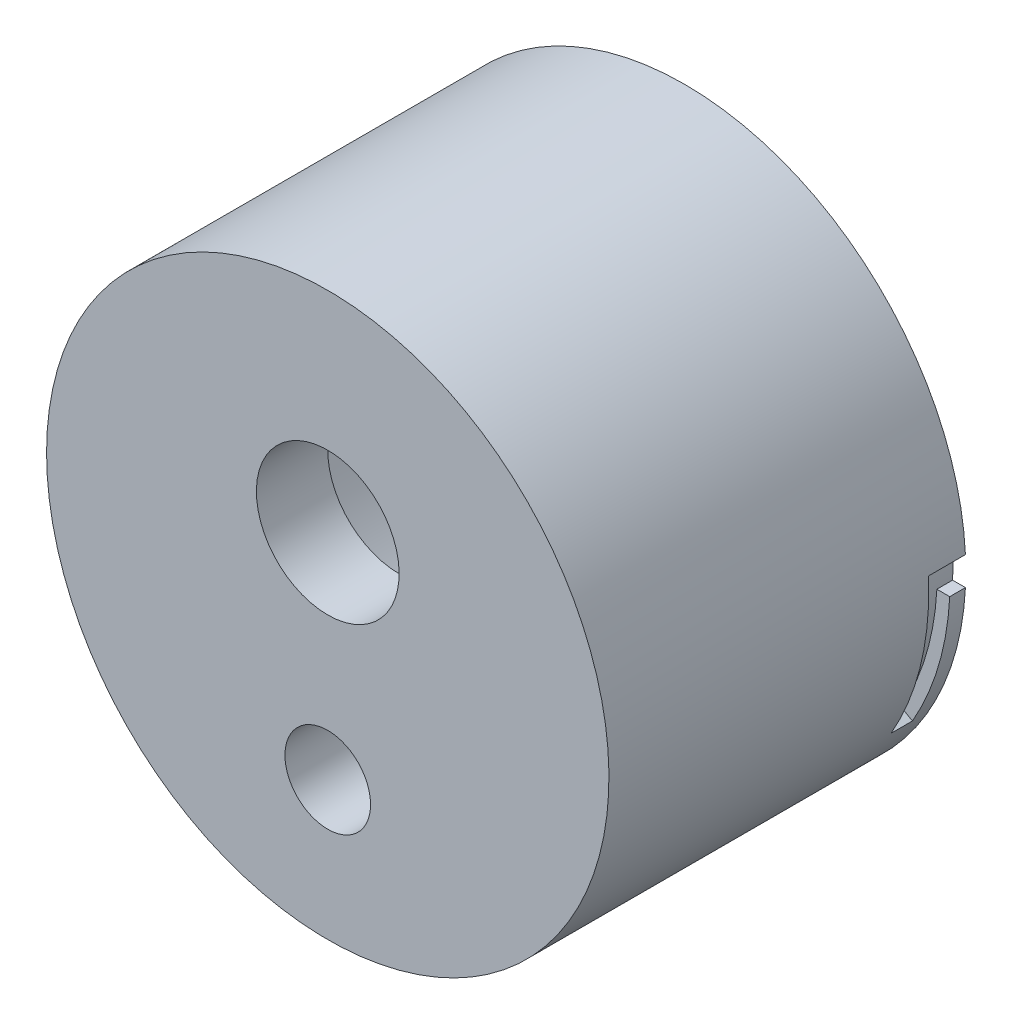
ISO-10303-21;
HEADER;
FILE_DESCRIPTION(('STEP AP214'),'2;1');
FILE_NAME('part.step','',(''),(''),'','','');
FILE_SCHEMA(('AUTOMOTIVE_DESIGN { 1 0 10303 214 1 1 1 1 }'));
ENDSEC;
DATA;
#1=APPLICATION_CONTEXT('core data for automotive mechanical design processes');
#2=APPLICATION_PROTOCOL_DEFINITION('international standard','automotive_design',2000,#1);
#3=PRODUCT_CONTEXT('',#1,'mechanical');
#4=PRODUCT('Part','Part','',(#3));
#5=PRODUCT_RELATED_PRODUCT_CATEGORY('part','',(#4));
#6=PRODUCT_DEFINITION_FORMATION('','',#4);
#7=PRODUCT_DEFINITION_CONTEXT('part definition',#1,'design');
#8=PRODUCT_DEFINITION('design','',#6,#7);
#9=PRODUCT_DEFINITION_SHAPE('','',#8);
#10=(LENGTH_UNIT() NAMED_UNIT(*) SI_UNIT(.MILLI.,.METRE.));
#11=(NAMED_UNIT(*) PLANE_ANGLE_UNIT() SI_UNIT($,.RADIAN.));
#12=(NAMED_UNIT(*) SI_UNIT($,.STERADIAN.) SOLID_ANGLE_UNIT());
#13=UNCERTAINTY_MEASURE_WITH_UNIT(LENGTH_MEASURE(1.E-05),#10,'distance_accuracy_value','');
#14=(GEOMETRIC_REPRESENTATION_CONTEXT(3) GLOBAL_UNCERTAINTY_ASSIGNED_CONTEXT((#13)) GLOBAL_UNIT_ASSIGNED_CONTEXT((#10,
#11,#12)) REPRESENTATION_CONTEXT('',''));
#15=CARTESIAN_POINT('',(0.,0.,0.));
#16=DIRECTION('',(0.,0.,1.));
#17=DIRECTION('',(1.,0.,0.));
#18=AXIS2_PLACEMENT_3D('',#15,#16,#17);
#19=CARTESIAN_POINT('',(44.3241344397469,-31.,-7.4));
#20=DIRECTION('',(0.,1.,0.));
#21=DIRECTION('',(0.,0.,1.));
#22=AXIS2_PLACEMENT_3D('',#19,#20,#21);
#23=PLANE('',#22);
#24=DIRECTION('',(0.,0.,-1.));
#25=VECTOR('',#24,1.);
#26=CARTESIAN_POINT('',(43.7733854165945,-31.,-7.4));
#27=LINE('',#26,#25);
#28=CARTESIAN_POINT('',(43.7733854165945,-31.,-8.9));
#29=VERTEX_POINT('',#28);
#30=CARTESIAN_POINT('',(43.7733854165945,-31.,-10.));
#31=VERTEX_POINT('',#30);
#32=EDGE_CURVE('E11',#29,#31,#27,.T.);
#33=ORIENTED_EDGE('',*,*,#32,.F.);
#34=DIRECTION('',(1.,0.,0.));
#35=VECTOR('',#34,1.);
#36=CARTESIAN_POINT('',(44.3241344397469,-31.,-8.9));
#37=LINE('',#36,#35);
#38=CARTESIAN_POINT('',(44.6746029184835,-31.,-8.9));
#39=VERTEX_POINT('',#38);
#40=EDGE_CURVE('E23',#29,#39,#37,.T.);
#41=ORIENTED_EDGE('',*,*,#40,.T.);
#42=DIRECTION('',(0.,0.,-1.));
#43=VECTOR('',#42,1.);
#44=CARTESIAN_POINT('',(44.6746029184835,-31.,-7.4));
#45=LINE('',#44,#43);
#46=CARTESIAN_POINT('',(44.6746029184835,-31.,-10.));
#47=VERTEX_POINT('',#46);
#48=EDGE_CURVE('E219',#39,#47,#45,.T.);
#49=ORIENTED_EDGE('',*,*,#48,.T.);
#50=DIRECTION('',(1.,0.,0.));
#51=VECTOR('',#50,1.);
#52=CARTESIAN_POINT('',(25.0967708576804,-31.,-10.));
#53=LINE('',#52,#51);
#54=EDGE_CURVE('E216',#31,#47,#53,.T.);
#55=ORIENTED_EDGE('',*,*,#54,.F.);
#56=EDGE_LOOP('',(#33,#41,#49,#55));
#57=FACE_BOUND('',#56,.T.);
#58=ADVANCED_FACE('F16',(#57),#23,.T.);
#59=CARTESIAN_POINT('',(25.,-30.,10.));
#60=DIRECTION('',(0.,0.,1.));
#61=DIRECTION('',(1.,0.,0.));
#62=AXIS2_PLACEMENT_3D('',#59,#60,#61);
#63=CYLINDRICAL_SURFACE('',#62,19.7);
#64=CARTESIAN_POINT('',(25.,-30.,15.));
#65=DIRECTION('',(0.,0.,-1.));
#66=DIRECTION('',(-1.,0.,0.));
#67=AXIS2_PLACEMENT_3D('',#64,#65,#66);
#68=CIRCLE('',#67,19.7);
#69=CARTESIAN_POINT('',(5.3,-30.,15.));
#70=VERTEX_POINT('',#69);
#71=EDGE_CURVE('E213',#70,#70,#68,.T.);
#72=ORIENTED_EDGE('',*,*,#71,.T.);
#73=EDGE_LOOP('',(#72));
#74=FACE_BOUND('',#73,.T.);
#75=DIRECTION('',(0.,0.,1.));
#76=VECTOR('',#75,1.);
#77=CARTESIAN_POINT('',(7.93929954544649,-20.15,-8.9));
#78=LINE('',#77,#76);
#79=CARTESIAN_POINT('',(7.93929954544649,-20.15,-8.9));
#80=VERTEX_POINT('',#79);
#81=CARTESIAN_POINT('',(7.93929954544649,-20.15,-7.4));
#82=VERTEX_POINT('',#81);
#83=EDGE_CURVE('E211',#80,#82,#78,.T.);
#84=ORIENTED_EDGE('',*,*,#83,.T.);
#85=CARTESIAN_POINT('',(25.,-30.,-7.4));
#86=DIRECTION('',(0.,0.,-1.));
#87=DIRECTION('',(-1.,0.,0.));
#88=AXIS2_PLACEMENT_3D('',#85,#86,#87);
#89=CIRCLE('',#88,19.7);
#90=CARTESIAN_POINT('',(5.32539708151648,-31.,-7.4));
#91=VERTEX_POINT('',#90);
#92=EDGE_CURVE('E208',#91,#82,#89,.T.);
#93=ORIENTED_EDGE('',*,*,#92,.F.);
#94=DIRECTION('',(0.,0.,-1.));
#95=VECTOR('',#94,1.);
#96=CARTESIAN_POINT('',(5.32539708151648,-31.,-7.4));
#97=LINE('',#96,#95);
#98=CARTESIAN_POINT('',(5.32539708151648,-31.,-10.));
#99=VERTEX_POINT('',#98);
#100=EDGE_CURVE('E206',#91,#99,#97,.T.);
#101=ORIENTED_EDGE('',*,*,#100,.T.);
#102=CARTESIAN_POINT('',(25.,-30.,-10.));
#103=DIRECTION('',(0.,0.,-1.));
#104=DIRECTION('',(-1.,0.,0.));
#105=AXIS2_PLACEMENT_3D('',#102,#103,#104);
#106=CIRCLE('',#105,19.7);
#107=EDGE_CURVE('E203',#47,#99,#106,.T.);
#108=ORIENTED_EDGE('',*,*,#107,.F.);
#109=ORIENTED_EDGE('',*,*,#48,.F.);
#110=CARTESIAN_POINT('',(25.,-30.,-8.9));
#111=DIRECTION('',(0.,0.,-1.));
#112=DIRECTION('',(-1.,0.,0.));
#113=AXIS2_PLACEMENT_3D('',#110,#111,#112);
#114=CIRCLE('',#113,19.7);
#115=CARTESIAN_POINT('',(42.0607004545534,-39.85,-8.9));
#116=VERTEX_POINT('',#115);
#117=EDGE_CURVE('E201',#39,#116,#114,.T.);
#118=ORIENTED_EDGE('',*,*,#117,.T.);
#119=DIRECTION('',(0.,0.,1.));
#120=VECTOR('',#119,1.);
#121=CARTESIAN_POINT('',(42.0607004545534,-39.85,-8.9));
#122=LINE('',#121,#120);
#123=CARTESIAN_POINT('',(42.0607004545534,-39.85,-7.4));
#124=VERTEX_POINT('',#123);
#125=EDGE_CURVE('E199',#116,#124,#122,.T.);
#126=ORIENTED_EDGE('',*,*,#125,.T.);
#127=CARTESIAN_POINT('',(44.6746029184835,-29.,-7.4));
#128=VERTEX_POINT('',#127);
#129=EDGE_CURVE('E198',#128,#124,#89,.T.);
#130=ORIENTED_EDGE('',*,*,#129,.F.);
#131=DIRECTION('',(0.,0.,-1.));
#132=VECTOR('',#131,1.);
#133=CARTESIAN_POINT('',(44.6746029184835,-29.,-7.4));
#134=LINE('',#133,#132);
#135=CARTESIAN_POINT('',(44.6746029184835,-29.,-10.));
#136=VERTEX_POINT('',#135);
#137=EDGE_CURVE('E196',#128,#136,#134,.T.);
#138=ORIENTED_EDGE('',*,*,#137,.T.);
#139=CARTESIAN_POINT('',(5.32539708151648,-29.,-10.));
#140=VERTEX_POINT('',#139);
#141=EDGE_CURVE('E195',#140,#136,#106,.T.);
#142=ORIENTED_EDGE('',*,*,#141,.F.);
#143=DIRECTION('',(0.,0.,-1.));
#144=VECTOR('',#143,1.);
#145=CARTESIAN_POINT('',(5.32539708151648,-29.,-7.4));
#146=LINE('',#145,#144);
#147=CARTESIAN_POINT('',(5.32539708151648,-29.,-8.9));
#148=VERTEX_POINT('',#147);
#149=EDGE_CURVE('E193',#148,#140,#146,.T.);
#150=ORIENTED_EDGE('',*,*,#149,.F.);
#151=CARTESIAN_POINT('',(25.,-30.,-8.9));
#152=DIRECTION('',(0.,0.,-1.));
#153=DIRECTION('',(-1.,0.,0.));
#154=AXIS2_PLACEMENT_3D('',#151,#152,#153);
#155=CIRCLE('',#154,19.7);
#156=EDGE_CURVE('E124',#148,#80,#155,.T.);
#157=ORIENTED_EDGE('',*,*,#156,.T.);
#158=EDGE_LOOP('',(#84,#93,#101,#108,#109,#118,#126,#130,#138,#142,#150,#157));
#159=FACE_BOUND('',#158,.T.);
#160=ADVANCED_FACE('F225',(#74,#159),#63,.T.);
#161=CARTESIAN_POINT('',(25.,-30.,-10.));
#162=DIRECTION('',(0.,0.,1.));
#163=DIRECTION('',(1.,0.,0.));
#164=AXIS2_PLACEMENT_3D('',#161,#162,#163);
#165=CYLINDRICAL_SURFACE('',#164,17.7);
#166=CARTESIAN_POINT('',(25.,-30.,10.));
#167=DIRECTION('',(0.,0.,-1.));
#168=DIRECTION('',(-1.,0.,0.));
#169=AXIS2_PLACEMENT_3D('',#166,#167,#168);
#170=CIRCLE('',#169,17.7);
#171=CARTESIAN_POINT('',(7.3,-30.,10.));
#172=VERTEX_POINT('',#171);
#173=EDGE_CURVE('E189',#172,#172,#170,.T.);
#174=ORIENTED_EDGE('',*,*,#173,.F.);
#175=EDGE_LOOP('',(#174));
#176=FACE_BOUND('',#175,.T.);
#177=CARTESIAN_POINT('',(25.,-30.,-10.));
#178=DIRECTION('',(0.,0.,-1.));
#179=DIRECTION('',(-1.,0.,0.));
#180=AXIS2_PLACEMENT_3D('',#177,#178,#179);
#181=CIRCLE('',#180,17.7);
#182=CARTESIAN_POINT('',(7.3,-30.,-10.));
#183=VERTEX_POINT('',#182);
#184=EDGE_CURVE('E186',#183,#183,#181,.T.);
#185=ORIENTED_EDGE('',*,*,#184,.T.);
#186=EDGE_LOOP('',(#185));
#187=FACE_BOUND('',#186,.T.);
#188=ADVANCED_FACE('F259',(#176,#187),#165,.F.);
#189=CARTESIAN_POINT('',(25.,-30.,10.));
#190=DIRECTION('',(0.,0.,-1.));
#191=DIRECTION('',(1.,0.,0.));
#192=AXIS2_PLACEMENT_3D('',#189,#190,#191);
#193=PLANE('',#192);
#194=CARTESIAN_POINT('',(25.,-40.,10.));
#195=DIRECTION('',(0.,0.,-1.));
#196=DIRECTION('',(0.,-1.,0.));
#197=AXIS2_PLACEMENT_3D('',#194,#195,#196);
#198=CIRCLE('',#197,3.);
#199=CARTESIAN_POINT('',(25.,-43.,10.));
#200=VERTEX_POINT('',#199);
#201=EDGE_CURVE('E183',#200,#200,#198,.T.);
#202=ORIENTED_EDGE('',*,*,#201,.F.);
#203=EDGE_LOOP('',(#202));
#204=FACE_BOUND('',#203,.T.);
#205=CARTESIAN_POINT('',(25.,-25.,10.));
#206=DIRECTION('',(0.,0.,-1.));
#207=DIRECTION('',(0.,-1.,0.));
#208=AXIS2_PLACEMENT_3D('',#205,#206,#207);
#209=CIRCLE('',#208,5.);
#210=CARTESIAN_POINT('',(25.,-30.,10.));
#211=VERTEX_POINT('',#210);
#212=EDGE_CURVE('E180',#211,#211,#209,.T.);
#213=ORIENTED_EDGE('',*,*,#212,.F.);
#214=EDGE_LOOP('',(#213));
#215=FACE_BOUND('',#214,.T.);
#216=ORIENTED_EDGE('',*,*,#173,.T.);
#217=EDGE_LOOP('',(#216));
#218=FACE_BOUND('',#217,.T.);
#219=ADVANCED_FACE('F264',(#204,#215,#218),#193,.T.);
#220=CARTESIAN_POINT('',(25.,-40.,10.));
#221=DIRECTION('',(0.,0.,1.));
#222=DIRECTION('',(1.,0.,0.));
#223=AXIS2_PLACEMENT_3D('',#220,#221,#222);
#224=CYLINDRICAL_SURFACE('',#223,3.);
#225=ORIENTED_EDGE('',*,*,#201,.T.);
#226=EDGE_LOOP('',(#225));
#227=FACE_BOUND('',#226,.T.);
#228=CARTESIAN_POINT('',(25.,-40.,15.));
#229=DIRECTION('',(0.,0.,-1.));
#230=DIRECTION('',(0.,-1.,0.));
#231=AXIS2_PLACEMENT_3D('',#228,#229,#230);
#232=CIRCLE('',#231,3.);
#233=CARTESIAN_POINT('',(25.,-43.,15.));
#234=VERTEX_POINT('',#233);
#235=EDGE_CURVE('E177',#234,#234,#232,.T.);
#236=ORIENTED_EDGE('',*,*,#235,.F.);
#237=EDGE_LOOP('',(#236));
#238=FACE_BOUND('',#237,.T.);
#239=ADVANCED_FACE('F270',(#227,#238),#224,.F.);
#240=CARTESIAN_POINT('',(25.,-25.,10.));
#241=DIRECTION('',(0.,0.,1.));
#242=DIRECTION('',(1.,0.,0.));
#243=AXIS2_PLACEMENT_3D('',#240,#241,#242);
#244=CYLINDRICAL_SURFACE('',#243,5.);
#245=ORIENTED_EDGE('',*,*,#212,.T.);
#246=EDGE_LOOP('',(#245));
#247=FACE_BOUND('',#246,.T.);
#248=CARTESIAN_POINT('',(25.,-25.,15.));
#249=DIRECTION('',(0.,0.,-1.));
#250=DIRECTION('',(0.,-1.,0.));
#251=AXIS2_PLACEMENT_3D('',#248,#249,#250);
#252=CIRCLE('',#251,5.);
#253=CARTESIAN_POINT('',(25.,-30.,15.));
#254=VERTEX_POINT('',#253);
#255=EDGE_CURVE('E174',#254,#254,#252,.T.);
#256=ORIENTED_EDGE('',*,*,#255,.F.);
#257=EDGE_LOOP('',(#256));
#258=FACE_BOUND('',#257,.T.);
#259=ADVANCED_FACE('F274',(#247,#258),#244,.F.);
#260=CARTESIAN_POINT('',(25.,-30.,15.));
#261=DIRECTION('',(0.,0.,-1.));
#262=DIRECTION('',(1.,0.,0.));
#263=AXIS2_PLACEMENT_3D('',#260,#261,#262);
#264=PLANE('',#263);
#265=ORIENTED_EDGE('',*,*,#255,.T.);
#266=EDGE_LOOP('',(#265));
#267=FACE_BOUND('',#266,.T.);
#268=ORIENTED_EDGE('',*,*,#235,.T.);
#269=EDGE_LOOP('',(#268));
#270=FACE_BOUND('',#269,.T.);
#271=ORIENTED_EDGE('',*,*,#71,.F.);
#272=EDGE_LOOP('',(#271));
#273=FACE_BOUND('',#272,.T.);
#274=ADVANCED_FACE('F278',(#267,#270,#273),#264,.F.);
#275=CARTESIAN_POINT('',(25.0967708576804,-30.3679229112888,-10.));
#276=DIRECTION('',(0.,0.,-1.));
#277=DIRECTION('',(1.,0.,0.));
#278=AXIS2_PLACEMENT_3D('',#275,#276,#277);
#279=PLANE('',#278);
#280=DIRECTION('',(-1.,0.,0.));
#281=VECTOR('',#280,1.);
#282=CARTESIAN_POINT('',(25.0967708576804,-31.,-10.));
#283=LINE('',#282,#281);
#284=CARTESIAN_POINT('',(6.22661458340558,-31.,-10.));
#285=VERTEX_POINT('',#284);
#286=EDGE_CURVE('E171',#285,#99,#283,.T.);
#287=ORIENTED_EDGE('',*,*,#286,.F.);
#288=CARTESIAN_POINT('',(24.9999999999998,-30.,-10.));
#289=DIRECTION('',(0.,0.,-1.));
#290=DIRECTION('',(-1.,0.,0.));
#291=AXIS2_PLACEMENT_3D('',#288,#289,#290);
#292=CIRCLE('',#291,18.7999999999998);
#293=CARTESIAN_POINT('',(6.22661458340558,-29.,-10.));
#294=VERTEX_POINT('',#293);
#295=EDGE_CURVE('E169',#294,#285,#292,.F.);
#296=ORIENTED_EDGE('',*,*,#295,.F.);
#297=DIRECTION('',(-1.,0.,0.));
#298=VECTOR('',#297,1.);
#299=CARTESIAN_POINT('',(25.0967708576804,-29.,-10.));
#300=LINE('',#299,#298);
#301=EDGE_CURVE('E121',#294,#140,#300,.T.);
#302=ORIENTED_EDGE('',*,*,#301,.T.);
#303=ORIENTED_EDGE('',*,*,#141,.T.);
#304=DIRECTION('',(1.,0.,0.));
#305=VECTOR('',#304,1.);
#306=CARTESIAN_POINT('',(25.0967708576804,-29.,-10.));
#307=LINE('',#306,#305);
#308=CARTESIAN_POINT('',(43.7733854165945,-29.,-10.));
#309=VERTEX_POINT('',#308);
#310=EDGE_CURVE('E165',#309,#136,#307,.T.);
#311=ORIENTED_EDGE('',*,*,#310,.F.);
#312=CARTESIAN_POINT('',(25.0000000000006,-30.,-10.));
#313=DIRECTION('',(0.,0.,-1.));
#314=DIRECTION('',(-1.,0.,0.));
#315=AXIS2_PLACEMENT_3D('',#312,#313,#314);
#316=CIRCLE('',#315,18.7999999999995);
#317=EDGE_CURVE('E162',#31,#309,#316,.F.);
#318=ORIENTED_EDGE('',*,*,#317,.F.);
#319=ORIENTED_EDGE('',*,*,#54,.T.);
#320=ORIENTED_EDGE('',*,*,#107,.T.);
#321=EDGE_LOOP('',(#287,#296,#302,#303,#311,#318,#319,#320));
#322=FACE_BOUND('',#321,.T.);
#323=ORIENTED_EDGE('',*,*,#184,.F.);
#324=EDGE_LOOP('',(#323));
#325=FACE_BOUND('',#324,.T.);
#326=ADVANCED_FACE('F228',(#322,#325),#279,.T.);
#327=CARTESIAN_POINT('',(25.0000000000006,-30.,-7.4));
#328=DIRECTION('',(0.,0.,-1.));
#329=DIRECTION('',(-1.,0.,0.));
#330=AXIS2_PLACEMENT_3D('',#327,#328,#329);
#331=CYLINDRICAL_SURFACE('',#330,18.7999999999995);
#332=ORIENTED_EDGE('',*,*,#317,.T.);
#333=DIRECTION('',(0.,0.,-1.));
#334=VECTOR('',#333,1.);
#335=CARTESIAN_POINT('',(43.7733854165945,-29.,-7.4));
#336=LINE('',#335,#334);
#337=CARTESIAN_POINT('',(43.7733854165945,-29.,-7.4));
#338=VERTEX_POINT('',#337);
#339=EDGE_CURVE('E159',#338,#309,#336,.T.);
#340=ORIENTED_EDGE('',*,*,#339,.F.);
#341=CARTESIAN_POINT('',(25.0000000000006,-30.,-7.4));
#342=DIRECTION('',(0.,0.,-1.));
#343=DIRECTION('',(-1.,0.,0.));
#344=AXIS2_PLACEMENT_3D('',#341,#342,#343);
#345=CIRCLE('',#344,18.7999999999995);
#346=CARTESIAN_POINT('',(41.2812775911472,-39.4,-7.4));
#347=VERTEX_POINT('',#346);
#348=EDGE_CURVE('E156',#347,#338,#345,.F.);
#349=ORIENTED_EDGE('',*,*,#348,.F.);
#350=DIRECTION('',(0.,0.,1.));
#351=VECTOR('',#350,1.);
#352=CARTESIAN_POINT('',(41.2812775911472,-39.4,-8.9));
#353=LINE('',#352,#351);
#354=CARTESIAN_POINT('',(41.2812775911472,-39.4,-8.9));
#355=VERTEX_POINT('',#354);
#356=EDGE_CURVE('E153',#355,#347,#353,.T.);
#357=ORIENTED_EDGE('',*,*,#356,.F.);
#358=CARTESIAN_POINT('',(25.,-30.,-8.9));
#359=DIRECTION('',(0.,0.,-1.));
#360=DIRECTION('',(-1.,0.,0.));
#361=AXIS2_PLACEMENT_3D('',#358,#359,#360);
#362=CIRCLE('',#361,18.7999999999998);
#363=EDGE_CURVE('E150',#29,#355,#362,.T.);
#364=ORIENTED_EDGE('',*,*,#363,.F.);
#365=ORIENTED_EDGE('',*,*,#32,.T.);
#366=EDGE_LOOP('',(#332,#340,#349,#357,#364,#365));
#367=FACE_BOUND('',#366,.T.);
#368=ADVANCED_FACE('F231',(#367),#331,.T.);
#369=CARTESIAN_POINT('',(44.3241344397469,-29.,-7.4));
#370=DIRECTION('',(0.,1.,0.));
#371=DIRECTION('',(0.,0.,1.));
#372=AXIS2_PLACEMENT_3D('',#369,#370,#371);
#373=PLANE('',#372);
#374=ORIENTED_EDGE('',*,*,#310,.T.);
#375=ORIENTED_EDGE('',*,*,#137,.F.);
#376=DIRECTION('',(1.,0.,0.));
#377=VECTOR('',#376,1.);
#378=CARTESIAN_POINT('',(44.3241344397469,-29.,-7.4));
#379=LINE('',#378,#377);
#380=EDGE_CURVE('E147',#338,#128,#379,.T.);
#381=ORIENTED_EDGE('',*,*,#380,.F.);
#382=ORIENTED_EDGE('',*,*,#339,.T.);
#383=EDGE_LOOP('',(#374,#375,#381,#382));
#384=FACE_BOUND('',#383,.T.);
#385=ADVANCED_FACE('F244',(#384),#373,.F.);
#386=CARTESIAN_POINT('',(25.,-30.,-7.4));
#387=DIRECTION('',(0.,0.,-1.));
#388=DIRECTION('',(1.,0.,0.));
#389=AXIS2_PLACEMENT_3D('',#386,#387,#388);
#390=PLANE('',#389);
#391=ORIENTED_EDGE('',*,*,#129,.T.);
#392=DIRECTION('',(0.866025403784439,-0.5,0.));
#393=VECTOR('',#392,1.);
#394=CARTESIAN_POINT('',(41.6709890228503,-39.625,-7.4));
#395=LINE('',#394,#393);
#396=EDGE_CURVE('E144',#347,#124,#395,.T.);
#397=ORIENTED_EDGE('',*,*,#396,.F.);
#398=ORIENTED_EDGE('',*,*,#348,.T.);
#399=ORIENTED_EDGE('',*,*,#380,.T.);
#400=EDGE_LOOP('',(#391,#397,#398,#399));
#401=FACE_BOUND('',#400,.T.);
#402=ADVANCED_FACE('F240',(#401),#390,.T.);
#403=ORIENTED_EDGE('',*,*,#92,.T.);
#404=DIRECTION('',(-0.866025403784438,0.5,0.));
#405=VECTOR('',#404,1.);
#406=CARTESIAN_POINT('',(8.3290109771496,-20.375,-7.4));
#407=LINE('',#406,#405);
#408=CARTESIAN_POINT('',(8.71872240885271,-20.6000000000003,-7.4));
#409=VERTEX_POINT('',#408);
#410=EDGE_CURVE('E141',#409,#82,#407,.T.);
#411=ORIENTED_EDGE('',*,*,#410,.F.);
#412=CARTESIAN_POINT('',(24.9999999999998,-30.,-7.4));
#413=DIRECTION('',(0.,0.,-1.));
#414=DIRECTION('',(-1.,0.,0.));
#415=AXIS2_PLACEMENT_3D('',#412,#413,#414);
#416=CIRCLE('',#415,18.7999999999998);
#417=CARTESIAN_POINT('',(6.22661458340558,-31.,-7.4));
#418=VERTEX_POINT('',#417);
#419=EDGE_CURVE('E139',#409,#418,#416,.F.);
#420=ORIENTED_EDGE('',*,*,#419,.T.);
#421=DIRECTION('',(-1.,0.,0.));
#422=VECTOR('',#421,1.);
#423=CARTESIAN_POINT('',(5.67586556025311,-31.,-7.4));
#424=LINE('',#423,#422);
#425=EDGE_CURVE('E136',#418,#91,#424,.T.);
#426=ORIENTED_EDGE('',*,*,#425,.T.);
#427=EDGE_LOOP('',(#403,#411,#420,#426));
#428=FACE_BOUND('',#427,.T.);
#429=ADVANCED_FACE('F252',(#428),#390,.T.);
#430=CARTESIAN_POINT('',(5.67586556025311,-31.,-7.4));
#431=DIRECTION('',(0.,-1.,0.));
#432=DIRECTION('',(0.,0.,-1.));
#433=AXIS2_PLACEMENT_3D('',#430,#431,#432);
#434=PLANE('',#433);
#435=ORIENTED_EDGE('',*,*,#286,.T.);
#436=ORIENTED_EDGE('',*,*,#100,.F.);
#437=ORIENTED_EDGE('',*,*,#425,.F.);
#438=DIRECTION('',(0.,0.,-1.));
#439=VECTOR('',#438,1.);
#440=CARTESIAN_POINT('',(6.22661458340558,-31.,-7.4));
#441=LINE('',#440,#439);
#442=EDGE_CURVE('E133',#418,#285,#441,.T.);
#443=ORIENTED_EDGE('',*,*,#442,.T.);
#444=EDGE_LOOP('',(#435,#436,#437,#443));
#445=FACE_BOUND('',#444,.T.);
#446=ADVANCED_FACE('F316',(#445),#434,.F.);
#447=CARTESIAN_POINT('',(24.9999999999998,-30.,-7.4));
#448=DIRECTION('',(0.,0.,-1.));
#449=DIRECTION('',(-1.,0.,0.));
#450=AXIS2_PLACEMENT_3D('',#447,#448,#449);
#451=CYLINDRICAL_SURFACE('',#450,18.7999999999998);
#452=ORIENTED_EDGE('',*,*,#295,.T.);
#453=ORIENTED_EDGE('',*,*,#442,.F.);
#454=ORIENTED_EDGE('',*,*,#419,.F.);
#455=DIRECTION('',(0.,0.,1.));
#456=VECTOR('',#455,1.);
#457=CARTESIAN_POINT('',(8.71872240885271,-20.6000000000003,-8.9));
#458=LINE('',#457,#456);
#459=CARTESIAN_POINT('',(8.71872240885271,-20.6000000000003,-8.9));
#460=VERTEX_POINT('',#459);
#461=EDGE_CURVE('E108',#460,#409,#458,.T.);
#462=ORIENTED_EDGE('',*,*,#461,.F.);
#463=CARTESIAN_POINT('',(25.,-30.,-8.9));
#464=DIRECTION('',(0.,0.,-1.));
#465=DIRECTION('',(-1.,0.,0.));
#466=AXIS2_PLACEMENT_3D('',#463,#464,#465);
#467=CIRCLE('',#466,18.7999999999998);
#468=CARTESIAN_POINT('',(6.22661458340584,-29.,-8.9));
#469=VERTEX_POINT('',#468);
#470=EDGE_CURVE('E100',#469,#460,#467,.T.);
#471=ORIENTED_EDGE('',*,*,#470,.F.);
#472=DIRECTION('',(0.,0.,-1.));
#473=VECTOR('',#472,1.);
#474=CARTESIAN_POINT('',(6.22661458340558,-29.,-7.4));
#475=LINE('',#474,#473);
#476=EDGE_CURVE('E104',#469,#294,#475,.T.);
#477=ORIENTED_EDGE('',*,*,#476,.T.);
#478=EDGE_LOOP('',(#452,#453,#454,#462,#471,#477));
#479=FACE_BOUND('',#478,.T.);
#480=ADVANCED_FACE('F103',(#479),#451,.T.);
#481=CARTESIAN_POINT('',(5.67586556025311,-29.,-7.4));
#482=DIRECTION('',(0.,-1.,0.));
#483=DIRECTION('',(0.,0.,-1.));
#484=AXIS2_PLACEMENT_3D('',#481,#482,#483);
#485=PLANE('',#484);
#486=DIRECTION('',(1.,0.,0.));
#487=VECTOR('',#486,1.);
#488=CARTESIAN_POINT('',(5.77600583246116,-29.,-8.9));
#489=LINE('',#488,#487);
#490=EDGE_CURVE('E118',#148,#469,#489,.T.);
#491=ORIENTED_EDGE('',*,*,#490,.F.);
#492=ORIENTED_EDGE('',*,*,#149,.T.);
#493=ORIENTED_EDGE('',*,*,#301,.F.);
#494=ORIENTED_EDGE('',*,*,#476,.F.);
#495=EDGE_LOOP('',(#491,#492,#493,#494));
#496=FACE_BOUND('',#495,.T.);
#497=ADVANCED_FACE('F116',(#496),#485,.T.);
#498=CARTESIAN_POINT('',(41.6709890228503,-39.625,-8.9));
#499=DIRECTION('',(-0.5,-0.866025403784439,0.));
#500=DIRECTION('',(0.866025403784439,-0.5,0.));
#501=AXIS2_PLACEMENT_3D('',#498,#499,#500);
#502=PLANE('',#501);
#503=ORIENTED_EDGE('',*,*,#396,.T.);
#504=ORIENTED_EDGE('',*,*,#125,.F.);
#505=DIRECTION('',(0.866025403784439,-0.5,0.));
#506=VECTOR('',#505,1.);
#507=CARTESIAN_POINT('',(41.6709890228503,-39.625,-8.9));
#508=LINE('',#507,#506);
#509=EDGE_CURVE('E125',#355,#116,#508,.T.);
#510=ORIENTED_EDGE('',*,*,#509,.F.);
#511=ORIENTED_EDGE('',*,*,#356,.T.);
#512=EDGE_LOOP('',(#503,#504,#510,#511));
#513=FACE_BOUND('',#512,.T.);
#514=ADVANCED_FACE('F237',(#513),#502,.F.);
#515=CARTESIAN_POINT('',(25.,-30.,-8.9));
#516=DIRECTION('',(0.,0.,-1.));
#517=DIRECTION('',(1.,0.,0.));
#518=AXIS2_PLACEMENT_3D('',#515,#516,#517);
#519=PLANE('',#518);
#520=ORIENTED_EDGE('',*,*,#40,.F.);
#521=ORIENTED_EDGE('',*,*,#363,.T.);
#522=ORIENTED_EDGE('',*,*,#509,.T.);
#523=ORIENTED_EDGE('',*,*,#117,.F.);
#524=EDGE_LOOP('',(#520,#521,#522,#523));
#525=FACE_BOUND('',#524,.T.);
#526=ADVANCED_FACE('F234',(#525),#519,.F.);
#527=CARTESIAN_POINT('',(8.3290109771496,-20.375,-8.9));
#528=DIRECTION('',(0.5,0.866025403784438,0.));
#529=DIRECTION('',(-0.866025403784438,0.5,0.));
#530=AXIS2_PLACEMENT_3D('',#527,#528,#529);
#531=PLANE('',#530);
#532=ORIENTED_EDGE('',*,*,#410,.T.);
#533=ORIENTED_EDGE('',*,*,#83,.F.);
#534=DIRECTION('',(-0.866025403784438,0.5,0.));
#535=VECTOR('',#534,1.);
#536=CARTESIAN_POINT('',(8.3290109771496,-20.375,-8.9));
#537=LINE('',#536,#535);
#538=EDGE_CURVE('E128',#460,#80,#537,.T.);
#539=ORIENTED_EDGE('',*,*,#538,.F.);
#540=ORIENTED_EDGE('',*,*,#461,.T.);
#541=EDGE_LOOP('',(#532,#533,#539,#540));
#542=FACE_BOUND('',#541,.T.);
#543=ADVANCED_FACE('F358',(#542),#531,.F.);
#544=CARTESIAN_POINT('',(25.,-30.,-8.9));
#545=DIRECTION('',(0.,0.,-1.));
#546=DIRECTION('',(1.,0.,0.));
#547=AXIS2_PLACEMENT_3D('',#544,#545,#546);
#548=PLANE('',#547);
#549=ORIENTED_EDGE('',*,*,#538,.T.);
#550=ORIENTED_EDGE('',*,*,#156,.F.);
#551=ORIENTED_EDGE('',*,*,#490,.T.);
#552=ORIENTED_EDGE('',*,*,#470,.T.);
#553=EDGE_LOOP('',(#549,#550,#551,#552));
#554=FACE_BOUND('',#553,.T.);
#555=ADVANCED_FACE('F123',(#554),#548,.F.);
#556=CLOSED_SHELL('',(#58,#160,#188,#219,#239,#259,#274,#326,#368,#385,#402,#429,#446,#480,#497,
#514,#526,#543,#555));
#557=MANIFOLD_SOLID_BREP('B1',#556);
#558=ADVANCED_BREP_SHAPE_REPRESENTATION('',(#18,#557),#14);
#559=SHAPE_DEFINITION_REPRESENTATION(#9,#558);
ENDSEC;
END-ISO-10303-21;
